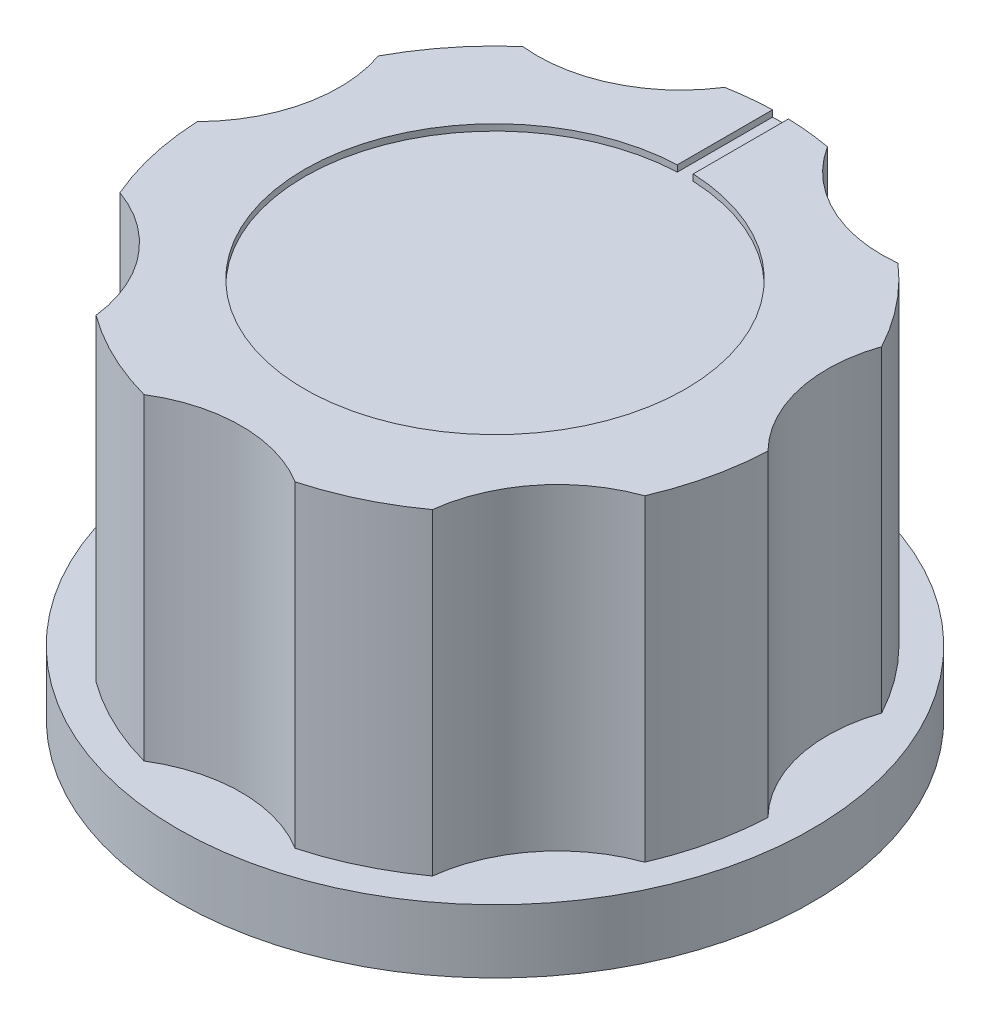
from build123d import *

# Parameters (mm, degrees)
CROQUIS1_W                                           = 10
CROQUIS1_H                                           = 2
SALIENTE_EXTRUIR1_DEPTH                              = 10
CORTAR_EXTRUIR1_START                                = -0.2
CORTAR_EXTRUIR1_DEPTH                                = 0.2
REFRENTADO_PARA_PERNO_CON_CABEZA_HEXAGON_D           = 7
REFRENTADO_PARA_PERNO_CON_CABEZA_HEXAGON_DEPTH       = 11
REFRENTADO_PARA_PERNO_CON_CABEZA_HEXAGON_CBORE_D     = 13
REFRENTADO_PARA_PERNO_CON_CABEZA_HEXAGON_CBORE_DEPTH = 2


with BuildPart() as part:
    # Croquis1 → Revoluci_n1 (revolve)
    with BuildSketch(Plane.XY, mode=Mode.PRIVATE) as revoluci_n1_sk:
        with Locations((5, 1)):
            Rectangle(CROQUIS1_W, CROQUIS1_H)
    revolve(revoluci_n1_sk.sketch.rotate(Axis((0, 2, 0), (0, -1, 0)), 270), axis=Axis((0, 2, 0), (0, -1, 0)))

    # Croquis2 → Saliente-Extruir1 (add)
    with BuildSketch(Plane(origin=(0, 2, 0), x_dir=(-1, 0, 0), z_dir=(0, 1, 0))):
        with BuildLine():
            ThreePointArc((-1.622199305, -8.852596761), (-3.472353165, -7.207614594), (-5.911876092, -6.785994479))
            ThreePointArc((-5.911876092, -6.785994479), (-7.037378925, -5.610285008), (-7.932729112, -4.251095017))
            ThreePointArc((-7.932729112, -4.251095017), (-7.800547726, -1.779622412), (-8.991546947, 0.389978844))
            ThreePointArc((-8.991546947, 0.389978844), (-8.774248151, 2.003139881), (-8.269943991, 3.55077828))
            ThreePointArc((-8.269943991, 3.55077828), (-6.255113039, 4.988594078), (-5.301550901, 7.272795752))
            ThreePointArc((-5.301550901, 7.272795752), (-3.905239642, 8.10858208), (-2.38125, 8.679265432))
            ThreePointArc((-2.38125, 8.679265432), (0, 8), (2.38125, 8.679265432))
            ThreePointArc((2.38125, 8.679265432), (3.90466786, 8.108857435), (5.300525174, 7.273543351))
            ThreePointArc((5.300525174, 7.273543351), (6.254190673, 4.987242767), (8.270871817, 3.548616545))
            ThreePointArc((8.270871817, 3.548616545), (8.774454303, 2.002236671), (8.991525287, 0.390477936))
            ThreePointArc((8.991525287, 0.390477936), (7.798298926, -1.780712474), (7.930831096, -4.254634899))
            ThreePointArc((7.930831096, -4.254634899), (7.035587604, -5.612531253), (5.910571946, -6.787130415))
            ThreePointArc((5.910571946, -6.787130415), (3.469786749, -7.207887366), (1.618521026, -8.85327))
            ThreePointArc((1.618521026, -8.85327), (-0.001869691, -8.999999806), (-1.622199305, -8.852596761))
        make_face()
    extrude(amount=SALIENTE_EXTRUIR1_DEPTH)

    # Croquis3 → Cortar-Extruir1 (cut)
    with BuildSketch(Plane(origin=(0, 12, 0), x_dir=(-1, 0, 0), z_dir=(0, 1, 0)).offset(CORTAR_EXTRUIR1_START)):
        with BuildLine():
            Line((0.25, -8.996527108), (0.25, -5.994789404))
            ThreePointArc((0.25, -5.994789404), (0, 6), (-0.25, -5.994789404))
            Line((-0.25, -5.994789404), (-0.25, -8.996527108))
            ThreePointArc((-0.25, -8.996527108), (0, -9), (0.25, -8.996527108))
        make_face()
    extrude(amount=CORTAR_EXTRUIR1_DEPTH, mode=Mode.SUBTRACT)

    # Refrentado para perno con cabeza hexagon
    with Locations(Plane(origin=(0, 0, 0), x_dir=(-1, 0, 0), z_dir=(0, -1, 0))):
        with Locations((0, 0)):
            CounterBoreHole(REFRENTADO_PARA_PERNO_CON_CABEZA_HEXAGON_D / 2, REFRENTADO_PARA_PERNO_CON_CABEZA_HEXAGON_CBORE_D / 2, REFRENTADO_PARA_PERNO_CON_CABEZA_HEXAGON_CBORE_DEPTH, depth=REFRENTADO_PARA_PERNO_CON_CABEZA_HEXAGON_DEPTH)


solid = part.part
